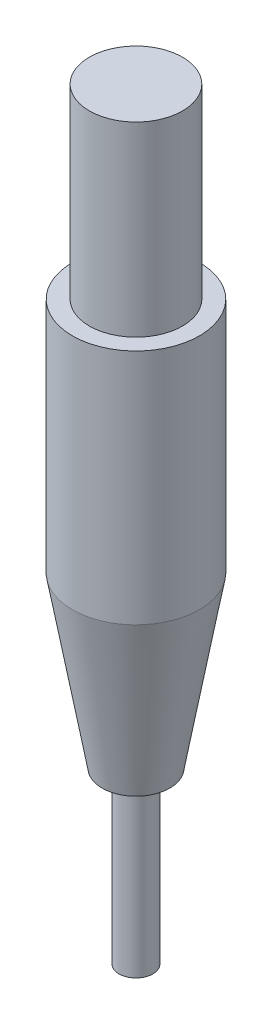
ISO-10303-21;
HEADER;
FILE_DESCRIPTION(('STEP AP214'),'2;1');
FILE_NAME('part.step','',(''),(''),'','','');
FILE_SCHEMA(('AUTOMOTIVE_DESIGN { 1 0 10303 214 1 1 1 1 }'));
ENDSEC;
DATA;
#1=APPLICATION_CONTEXT('core data for automotive mechanical design processes');
#2=APPLICATION_PROTOCOL_DEFINITION('international standard','automotive_design',2000,#1);
#3=PRODUCT_CONTEXT('',#1,'mechanical');
#4=PRODUCT('Part','Part','',(#3));
#5=PRODUCT_RELATED_PRODUCT_CATEGORY('part','',(#4));
#6=PRODUCT_DEFINITION_FORMATION('','',#4);
#7=PRODUCT_DEFINITION_CONTEXT('part definition',#1,'design');
#8=PRODUCT_DEFINITION('design','',#6,#7);
#9=PRODUCT_DEFINITION_SHAPE('','',#8);
#10=(LENGTH_UNIT() NAMED_UNIT(*) SI_UNIT(.MILLI.,.METRE.));
#11=(NAMED_UNIT(*) PLANE_ANGLE_UNIT() SI_UNIT($,.RADIAN.));
#12=(NAMED_UNIT(*) SI_UNIT($,.STERADIAN.) SOLID_ANGLE_UNIT());
#13=UNCERTAINTY_MEASURE_WITH_UNIT(LENGTH_MEASURE(1.E-05),#10,'distance_accuracy_value','');
#14=(GEOMETRIC_REPRESENTATION_CONTEXT(3) GLOBAL_UNCERTAINTY_ASSIGNED_CONTEXT((#13)) GLOBAL_UNIT_ASSIGNED_CONTEXT((#10,
#11,#12)) REPRESENTATION_CONTEXT('',''));
#15=CARTESIAN_POINT('',(0.,0.,0.));
#16=DIRECTION('',(0.,0.,1.));
#17=DIRECTION('',(1.,0.,0.));
#18=AXIS2_PLACEMENT_3D('',#15,#16,#17);
#19=CARTESIAN_POINT('',(0.,4.624331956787,0.));
#20=DIRECTION('',(0.,-1.,0.));
#21=DIRECTION('',(0.,0.,-1.));
#22=AXIS2_PLACEMENT_3D('',#19,#20,#21);
#23=PLANE('',#22);
#24=CARTESIAN_POINT('',(0.,4.624331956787,0.));
#25=DIRECTION('',(0.,1.,0.));
#26=DIRECTION('',(0.,0.,1.));
#27=AXIS2_PLACEMENT_3D('',#24,#25,#26);
#28=CIRCLE('',#27,0.999999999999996);
#29=CARTESIAN_POINT('',(0.,4.624331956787,0.999999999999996));
#30=VERTEX_POINT('',#29);
#31=EDGE_CURVE('E10',#30,#30,#28,.T.);
#32=ORIENTED_EDGE('',*,*,#31,.F.);
#33=EDGE_LOOP('',(#32));
#34=FACE_BOUND('',#33,.T.);
#35=ADVANCED_FACE('F33',(#34),#23,.T.);
#36=CARTESIAN_POINT('',(0.,32.0359611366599,0.));
#37=DIRECTION('',(0.,1.,0.));
#38=DIRECTION('',(0.,0.,1.));
#39=AXIS2_PLACEMENT_3D('',#36,#37,#38);
#40=CYLINDRICAL_SURFACE('',#39,0.999999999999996);
#41=ORIENTED_EDGE('',*,*,#31,.T.);
#42=EDGE_LOOP('',(#41));
#43=FACE_BOUND('',#42,.T.);
#44=CARTESIAN_POINT('',(0.,14.624331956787,0.));
#45=DIRECTION('',(0.,1.,0.));
#46=DIRECTION('',(0.,0.,1.));
#47=AXIS2_PLACEMENT_3D('',#44,#45,#46);
#48=CIRCLE('',#47,0.999999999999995);
#49=CARTESIAN_POINT('',(0.,14.624331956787,0.999999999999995));
#50=VERTEX_POINT('',#49);
#51=EDGE_CURVE('E39',#50,#50,#48,.T.);
#52=ORIENTED_EDGE('',*,*,#51,.F.);
#53=EDGE_LOOP('',(#52));
#54=FACE_BOUND('',#53,.T.);
#55=ADVANCED_FACE('F78',(#43,#54),#40,.T.);
#56=CARTESIAN_POINT('',(0.,14.624331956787,0.999999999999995));
#57=DIRECTION('',(0.,-1.,0.));
#58=DIRECTION('',(0.,0.,-1.));
#59=AXIS2_PLACEMENT_3D('',#56,#57,#58);
#60=PLANE('',#59);
#61=ORIENTED_EDGE('',*,*,#51,.T.);
#62=EDGE_LOOP('',(#61));
#63=FACE_BOUND('',#62,.T.);
#64=CARTESIAN_POINT('',(0.,14.624331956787,0.));
#65=DIRECTION('',(0.,1.,0.));
#66=DIRECTION('',(0.,0.,1.));
#67=AXIS2_PLACEMENT_3D('',#64,#65,#66);
#68=CIRCLE('',#67,2.);
#69=CARTESIAN_POINT('',(0.,14.624331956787,2.));
#70=VERTEX_POINT('',#69);
#71=EDGE_CURVE('E43',#70,#70,#68,.T.);
#72=ORIENTED_EDGE('',*,*,#71,.F.);
#73=EDGE_LOOP('',(#72));
#74=FACE_BOUND('',#73,.T.);
#75=ADVANCED_FACE('F83',(#63,#74),#60,.T.);
#76=CARTESIAN_POINT('',(0.,24.624331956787,0.));
#77=DIRECTION('',(0.,1.,0.));
#78=DIRECTION('',(0.,0.,1.));
#79=AXIS2_PLACEMENT_3D('',#76,#77,#78);
#80=CONICAL_SURFACE('',#79,3.75,0.173245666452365);
#81=ORIENTED_EDGE('',*,*,#71,.T.);
#82=EDGE_LOOP('',(#81));
#83=FACE_BOUND('',#82,.T.);
#84=CARTESIAN_POINT('',(0.,24.624331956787,0.));
#85=DIRECTION('',(0.,1.,0.));
#86=DIRECTION('',(0.,0.,1.));
#87=AXIS2_PLACEMENT_3D('',#84,#85,#86);
#88=CIRCLE('',#87,3.75);
#89=CARTESIAN_POINT('',(0.,24.624331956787,3.75));
#90=VERTEX_POINT('',#89);
#91=EDGE_CURVE('E47',#90,#90,#88,.T.);
#92=ORIENTED_EDGE('',*,*,#91,.F.);
#93=EDGE_LOOP('',(#92));
#94=FACE_BOUND('',#93,.T.);
#95=ADVANCED_FACE('F87',(#83,#94),#80,.T.);
#96=CARTESIAN_POINT('',(0.,32.0359611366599,0.));
#97=DIRECTION('',(0.,1.,0.));
#98=DIRECTION('',(0.,0.,1.));
#99=AXIS2_PLACEMENT_3D('',#96,#97,#98);
#100=CYLINDRICAL_SURFACE('',#99,3.75);
#101=ORIENTED_EDGE('',*,*,#91,.T.);
#102=EDGE_LOOP('',(#101));
#103=FACE_BOUND('',#102,.T.);
#104=CARTESIAN_POINT('',(0.,38.624331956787,0.));
#105=DIRECTION('',(0.,1.,0.));
#106=DIRECTION('',(0.,0.,1.));
#107=AXIS2_PLACEMENT_3D('',#104,#105,#106);
#108=CIRCLE('',#107,3.75);
#109=CARTESIAN_POINT('',(0.,38.624331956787,3.75));
#110=VERTEX_POINT('',#109);
#111=EDGE_CURVE('E52',#110,#110,#108,.T.);
#112=ORIENTED_EDGE('',*,*,#111,.F.);
#113=EDGE_LOOP('',(#112));
#114=FACE_BOUND('',#113,.T.);
#115=ADVANCED_FACE('F74',(#103,#114),#100,.T.);
#116=CARTESIAN_POINT('',(0.,38.624331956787,3.75));
#117=DIRECTION('',(0.,1.,0.));
#118=DIRECTION('',(0.,0.,1.));
#119=AXIS2_PLACEMENT_3D('',#116,#117,#118);
#120=PLANE('',#119);
#121=ORIENTED_EDGE('',*,*,#111,.T.);
#122=EDGE_LOOP('',(#121));
#123=FACE_BOUND('',#122,.T.);
#124=CARTESIAN_POINT('',(0.,38.624331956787,0.));
#125=DIRECTION('',(0.,1.,0.));
#126=DIRECTION('',(0.,0.,1.));
#127=AXIS2_PLACEMENT_3D('',#124,#125,#126);
#128=CIRCLE('',#127,2.75);
#129=CARTESIAN_POINT('',(0.,38.624331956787,2.75));
#130=VERTEX_POINT('',#129);
#131=EDGE_CURVE('E55',#130,#130,#128,.T.);
#132=ORIENTED_EDGE('',*,*,#131,.F.);
#133=EDGE_LOOP('',(#132));
#134=FACE_BOUND('',#133,.T.);
#135=ADVANCED_FACE('F66',(#123,#134),#120,.T.);
#136=CARTESIAN_POINT('',(0.,32.0359611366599,0.));
#137=DIRECTION('',(0.,1.,0.));
#138=DIRECTION('',(0.,0.,1.));
#139=AXIS2_PLACEMENT_3D('',#136,#137,#138);
#140=CYLINDRICAL_SURFACE('',#139,2.75);
#141=ORIENTED_EDGE('',*,*,#131,.T.);
#142=EDGE_LOOP('',(#141));
#143=FACE_BOUND('',#142,.T.);
#144=CARTESIAN_POINT('',(0.,49.624331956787,0.));
#145=DIRECTION('',(0.,1.,0.));
#146=DIRECTION('',(0.,0.,1.));
#147=AXIS2_PLACEMENT_3D('',#144,#145,#146);
#148=CIRCLE('',#147,2.75);
#149=CARTESIAN_POINT('',(0.,49.624331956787,2.75));
#150=VERTEX_POINT('',#149);
#151=EDGE_CURVE('E58',#150,#150,#148,.T.);
#152=ORIENTED_EDGE('',*,*,#151,.F.);
#153=EDGE_LOOP('',(#152));
#154=FACE_BOUND('',#153,.T.);
#155=ADVANCED_FACE('F64',(#143,#154),#140,.T.);
#156=CARTESIAN_POINT('',(0.,49.624331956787,2.75));
#157=DIRECTION('',(0.,1.,0.));
#158=DIRECTION('',(0.,0.,1.));
#159=AXIS2_PLACEMENT_3D('',#156,#157,#158);
#160=PLANE('',#159);
#161=ORIENTED_EDGE('',*,*,#151,.T.);
#162=EDGE_LOOP('',(#161));
#163=FACE_BOUND('',#162,.T.);
#164=ADVANCED_FACE('F62',(#163),#160,.T.);
#165=CLOSED_SHELL('',(#35,#55,#75,#95,#115,#135,#155,#164));
#166=MANIFOLD_SOLID_BREP('B2',#165);
#167=ADVANCED_BREP_SHAPE_REPRESENTATION('',(#18,#166),#14);
#168=SHAPE_DEFINITION_REPRESENTATION(#9,#167);
ENDSEC;
END-ISO-10303-21;
